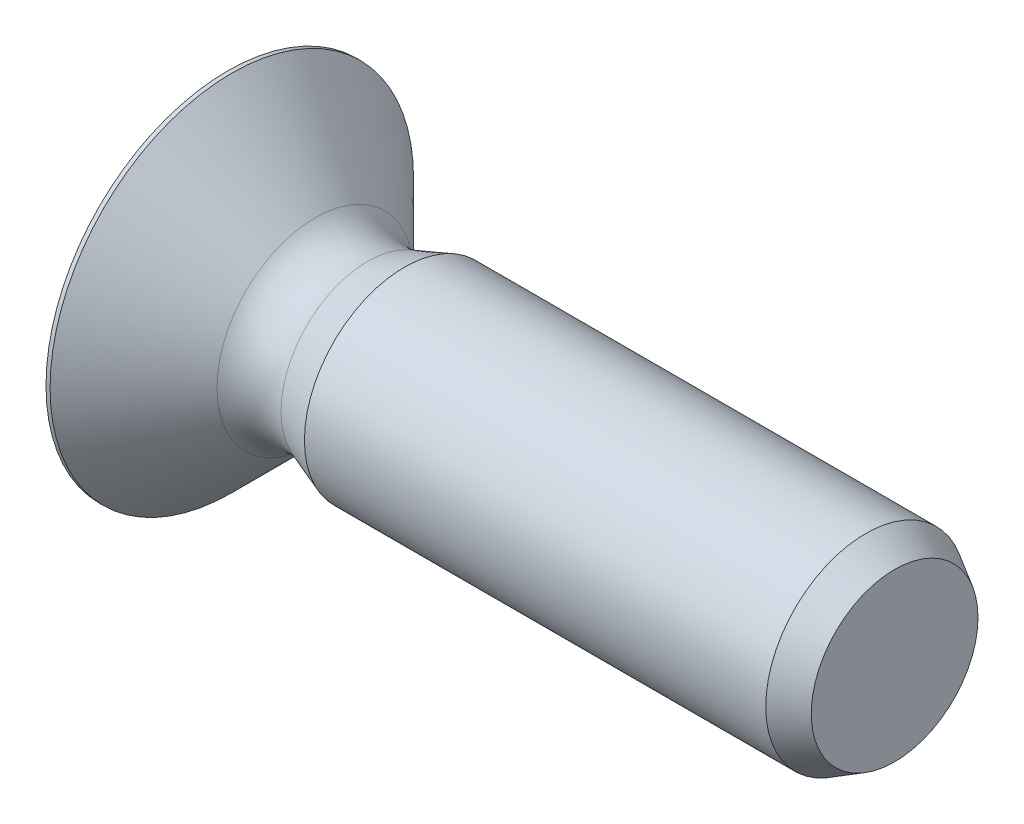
from build123d import *

# Parameters (mm, degrees)
CROSSRECESS_DEPTH = 1.65
DRAFT1_ANGLE      = 45
FILLET1_R         = 1.5


with BuildPart() as part:
    # Sketch1 → Base (revolve)
    with BuildSketch(Plane.XY, mode=Mode.PRIVATE) as base_sk:
        Polygon((20, 0), (20, 3), (5.3, 3), (3.3, 2.272059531), (0.122059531, 5.45), (0, 5.45), (0, 0), align=None)
    revolve(base_sk.sketch.rotate(Axis((-38.105406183, 0, 0), (1, 0, 0)), 90), axis=Axis((-38.105406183, 0, 0), (1, 0, 0)))

    # Sketch2 → BaseEnd (revolve, cut)
    with BuildSketch(Plane(origin=(0, 0, 0), x_dir=(1, 0, 0), z_dir=(0, 1, 0))):
        Polygon((19.133974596, -3), (20, -2.5), (20, -3), align=None)
    revolve(axis=Axis((21.328193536, 0, 0), (-1, 0, 0)), mode=Mode.SUBTRACT)

    # Sketch3 → CrossRecess (cut)
    with BuildSketch(Plane(origin=(0, 0, 0), x_dir=(0, 0, -1), z_dir=(1, 0, 0))):
        Polygon((0.73, 3.65), (-0.73, 3.65), (-0.73, 0.73), (-3.65, 0.73), (-3.65, -0.73), (-0.73, -0.73), (-0.73, -3.65), (0.73, -3.65), (0.73, -0.73), (3.65, -0.73), (3.65, 0.73), (0.73, 0.73), align=None)
    extrude(amount=CROSSRECESS_DEPTH, mode=Mode.SUBTRACT)

    # Draft1
    draft1_faces = [part.faces().sort_by_distance(p)[0] for p in [
        (0.825, -3.65, 0),
        (0.825, 0, -3.65),
        (0.825, 0, 3.65),
        (0.825, 3.65, 0),
    ]]
    draft(draft1_faces, Plane(origin=(0, 5.45, 0), x_dir=(0, 0, -1), z_dir=(-1, 0, 0)), DRAFT1_ANGLE)

    # Fillet1
    fillet1_edges = [part.edges().sort_by_distance(p)[0] for p in [
        (3.3, 0, -2.272059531),
    ]]
    fillet(fillet1_edges, radius=FILLET1_R)


solid = part.part
